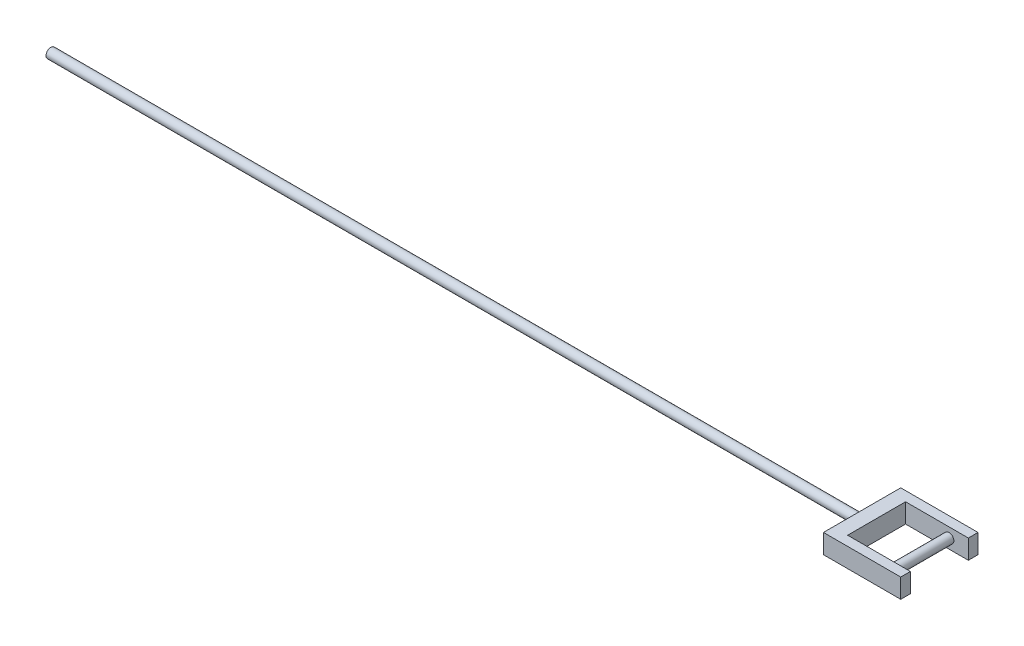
ISO-10303-21;
HEADER;
FILE_DESCRIPTION(('STEP AP214'),'2;1');
FILE_NAME('part.step','',(''),(''),'','','');
FILE_SCHEMA(('AUTOMOTIVE_DESIGN { 1 0 10303 214 1 1 1 1 }'));
ENDSEC;
DATA;
#1=APPLICATION_CONTEXT('core data for automotive mechanical design processes');
#2=APPLICATION_PROTOCOL_DEFINITION('international standard','automotive_design',2000,#1);
#3=PRODUCT_CONTEXT('',#1,'mechanical');
#4=PRODUCT('Part','Part','',(#3));
#5=PRODUCT_RELATED_PRODUCT_CATEGORY('part','',(#4));
#6=PRODUCT_DEFINITION_FORMATION('','',#4);
#7=PRODUCT_DEFINITION_CONTEXT('part definition',#1,'design');
#8=PRODUCT_DEFINITION('design','',#6,#7);
#9=PRODUCT_DEFINITION_SHAPE('','',#8);
#10=(LENGTH_UNIT() NAMED_UNIT(*) SI_UNIT(.MILLI.,.METRE.));
#11=(NAMED_UNIT(*) PLANE_ANGLE_UNIT() SI_UNIT($,.RADIAN.));
#12=(NAMED_UNIT(*) SI_UNIT($,.STERADIAN.) SOLID_ANGLE_UNIT());
#13=UNCERTAINTY_MEASURE_WITH_UNIT(LENGTH_MEASURE(1.E-05),#10,'distance_accuracy_value','');
#14=(GEOMETRIC_REPRESENTATION_CONTEXT(3) GLOBAL_UNCERTAINTY_ASSIGNED_CONTEXT((#13)) GLOBAL_UNIT_ASSIGNED_CONTEXT((#10,
#11,#12)) REPRESENTATION_CONTEXT('',''));
#15=CARTESIAN_POINT('',(0.,0.,0.));
#16=DIRECTION('',(0.,0.,1.));
#17=DIRECTION('',(1.,0.,0.));
#18=AXIS2_PLACEMENT_3D('',#15,#16,#17);
#19=CARTESIAN_POINT('',(50.8,25.4,-76.2));
#20=DIRECTION('',(-1.,0.,0.));
#21=DIRECTION('',(0.,0.,1.));
#22=AXIS2_PLACEMENT_3D('',#19,#20,#21);
#23=PLANE('',#22);
#24=DIRECTION('',(0.,0.,-1.));
#25=VECTOR('',#24,1.);
#26=CARTESIAN_POINT('',(50.8,-25.4,-76.2));
#27=LINE('',#26,#25);
#28=CARTESIAN_POINT('',(50.8,-25.4,-76.2));
#29=VERTEX_POINT('',#28);
#30=CARTESIAN_POINT('',(50.8,-25.4,-101.6));
#31=VERTEX_POINT('',#30);
#32=EDGE_CURVE('E131',#29,#31,#27,.T.);
#33=ORIENTED_EDGE('',*,*,#32,.T.);
#34=DIRECTION('',(0.,-1.,0.));
#35=VECTOR('',#34,1.);
#36=CARTESIAN_POINT('',(50.8,25.4,-101.6));
#37=LINE('',#36,#35);
#38=CARTESIAN_POINT('',(50.8,25.4,-101.6));
#39=VERTEX_POINT('',#38);
#40=EDGE_CURVE('E42',#39,#31,#37,.T.);
#41=ORIENTED_EDGE('',*,*,#40,.F.);
#42=DIRECTION('',(0.,0.,-1.));
#43=VECTOR('',#42,1.);
#44=CARTESIAN_POINT('',(50.8,25.4,-76.2));
#45=LINE('',#44,#43);
#46=CARTESIAN_POINT('',(50.8,25.4,-76.2));
#47=VERTEX_POINT('',#46);
#48=EDGE_CURVE('E146',#47,#39,#45,.T.);
#49=ORIENTED_EDGE('',*,*,#48,.F.);
#50=DIRECTION('',(0.,-1.,0.));
#51=VECTOR('',#50,1.);
#52=CARTESIAN_POINT('',(50.8,25.4,-76.2));
#53=LINE('',#52,#51);
#54=EDGE_CURVE('E127',#47,#29,#53,.T.);
#55=ORIENTED_EDGE('',*,*,#54,.T.);
#56=EDGE_LOOP('',(#33,#41,#49,#55));
#57=FACE_BOUND('',#56,.T.);
#58=ADVANCED_FACE('F34',(#57),#23,.F.);
#59=CARTESIAN_POINT('',(50.8,25.4,-101.6));
#60=DIRECTION('',(0.,0.,1.));
#61=DIRECTION('',(1.,0.,0.));
#62=AXIS2_PLACEMENT_3D('',#59,#60,#61);
#63=PLANE('',#62);
#64=DIRECTION('',(-1.,0.,0.));
#65=VECTOR('',#64,1.);
#66=CARTESIAN_POINT('',(50.8,-25.4,-101.6));
#67=LINE('',#66,#65);
#68=CARTESIAN_POINT('',(-152.4,-25.4,-101.6));
#69=VERTEX_POINT('',#68);
#70=EDGE_CURVE('E134',#31,#69,#67,.T.);
#71=ORIENTED_EDGE('',*,*,#70,.T.);
#72=DIRECTION('',(0.,-1.,0.));
#73=VECTOR('',#72,1.);
#74=CARTESIAN_POINT('',(-152.4,25.4,-101.6));
#75=LINE('',#74,#73);
#76=CARTESIAN_POINT('',(-152.4,25.4,-101.6));
#77=VERTEX_POINT('',#76);
#78=EDGE_CURVE('E156',#77,#69,#75,.T.);
#79=ORIENTED_EDGE('',*,*,#78,.F.);
#80=DIRECTION('',(-1.,0.,0.));
#81=VECTOR('',#80,1.);
#82=CARTESIAN_POINT('',(50.8,25.4,-101.6));
#83=LINE('',#82,#81);
#84=EDGE_CURVE('E94',#39,#77,#83,.T.);
#85=ORIENTED_EDGE('',*,*,#84,.F.);
#86=ORIENTED_EDGE('',*,*,#40,.T.);
#87=EDGE_LOOP('',(#71,#79,#85,#86));
#88=FACE_BOUND('',#87,.T.);
#89=ADVANCED_FACE('F159',(#88),#63,.F.);
#90=CARTESIAN_POINT('',(-152.4,25.4,-101.6));
#91=DIRECTION('',(1.,0.,0.));
#92=DIRECTION('',(0.,0.,-1.));
#93=AXIS2_PLACEMENT_3D('',#90,#91,#92);
#94=PLANE('',#93);
#95=CARTESIAN_POINT('',(-152.4,0.,0.));
#96=DIRECTION('',(1.,0.,0.));
#97=DIRECTION('',(0.,0.,-1.));
#98=AXIS2_PLACEMENT_3D('',#95,#96,#97);
#99=CIRCLE('',#98,12.7);
#100=CARTESIAN_POINT('',(-152.4,0.,-12.7));
#101=VERTEX_POINT('',#100);
#102=EDGE_CURVE('E11',#101,#101,#99,.F.);
#103=ORIENTED_EDGE('',*,*,#102,.F.);
#104=EDGE_LOOP('',(#103));
#105=FACE_BOUND('',#104,.T.);
#106=DIRECTION('',(0.,0.,1.));
#107=VECTOR('',#106,1.);
#108=CARTESIAN_POINT('',(-152.4,-25.4,-101.6));
#109=LINE('',#108,#107);
#110=CARTESIAN_POINT('',(-152.4,-25.4,101.6));
#111=VERTEX_POINT('',#110);
#112=EDGE_CURVE('E137',#69,#111,#109,.T.);
#113=ORIENTED_EDGE('',*,*,#112,.T.);
#114=DIRECTION('',(0.,-1.,0.));
#115=VECTOR('',#114,1.);
#116=CARTESIAN_POINT('',(-152.4,25.4,101.6));
#117=LINE('',#116,#115);
#118=CARTESIAN_POINT('',(-152.4,25.4,101.6));
#119=VERTEX_POINT('',#118);
#120=EDGE_CURVE('E153',#119,#111,#117,.T.);
#121=ORIENTED_EDGE('',*,*,#120,.F.);
#122=DIRECTION('',(0.,0.,1.));
#123=VECTOR('',#122,1.);
#124=CARTESIAN_POINT('',(-152.4,25.4,-101.6));
#125=LINE('',#124,#123);
#126=EDGE_CURVE('E177',#77,#119,#125,.T.);
#127=ORIENTED_EDGE('',*,*,#126,.F.);
#128=ORIENTED_EDGE('',*,*,#78,.T.);
#129=EDGE_LOOP('',(#113,#121,#127,#128));
#130=FACE_BOUND('',#129,.T.);
#131=ADVANCED_FACE('F170',(#105,#130),#94,.F.);
#132=CARTESIAN_POINT('',(-152.4,25.4,101.6));
#133=DIRECTION('',(0.,0.,-1.));
#134=DIRECTION('',(-1.,0.,0.));
#135=AXIS2_PLACEMENT_3D('',#132,#133,#134);
#136=PLANE('',#135);
#137=DIRECTION('',(1.,0.,0.));
#138=VECTOR('',#137,1.);
#139=CARTESIAN_POINT('',(-152.4,-25.4,101.6));
#140=LINE('',#139,#138);
#141=CARTESIAN_POINT('',(50.8,-25.4,101.6));
#142=VERTEX_POINT('',#141);
#143=EDGE_CURVE('E139',#111,#142,#140,.T.);
#144=ORIENTED_EDGE('',*,*,#143,.T.);
#145=DIRECTION('',(0.,-1.,0.));
#146=VECTOR('',#145,1.);
#147=CARTESIAN_POINT('',(50.8,25.4,101.6));
#148=LINE('',#147,#146);
#149=CARTESIAN_POINT('',(50.8,25.4,101.6));
#150=VERTEX_POINT('',#149);
#151=EDGE_CURVE('E150',#150,#142,#148,.T.);
#152=ORIENTED_EDGE('',*,*,#151,.F.);
#153=DIRECTION('',(1.,0.,0.));
#154=VECTOR('',#153,1.);
#155=CARTESIAN_POINT('',(-152.4,25.4,101.6));
#156=LINE('',#155,#154);
#157=EDGE_CURVE('E176',#119,#150,#156,.T.);
#158=ORIENTED_EDGE('',*,*,#157,.F.);
#159=ORIENTED_EDGE('',*,*,#120,.T.);
#160=EDGE_LOOP('',(#144,#152,#158,#159));
#161=FACE_BOUND('',#160,.T.);
#162=ADVANCED_FACE('F174',(#161),#136,.F.);
#163=CARTESIAN_POINT('',(50.8,25.4,101.6));
#164=DIRECTION('',(-1.,0.,0.));
#165=DIRECTION('',(0.,0.,1.));
#166=AXIS2_PLACEMENT_3D('',#163,#164,#165);
#167=PLANE('',#166);
#168=DIRECTION('',(0.,0.,-1.));
#169=VECTOR('',#168,1.);
#170=CARTESIAN_POINT('',(50.8,-25.4,101.6));
#171=LINE('',#170,#169);
#172=CARTESIAN_POINT('',(50.8,-25.4,76.2));
#173=VERTEX_POINT('',#172);
#174=EDGE_CURVE('E141',#142,#173,#171,.T.);
#175=ORIENTED_EDGE('',*,*,#174,.T.);
#176=DIRECTION('',(0.,-1.,0.));
#177=VECTOR('',#176,1.);
#178=CARTESIAN_POINT('',(50.8,25.4,76.2));
#179=LINE('',#178,#177);
#180=CARTESIAN_POINT('',(50.8,25.4,76.2));
#181=VERTEX_POINT('',#180);
#182=EDGE_CURVE('E122',#181,#173,#179,.T.);
#183=ORIENTED_EDGE('',*,*,#182,.F.);
#184=DIRECTION('',(0.,0.,-1.));
#185=VECTOR('',#184,1.);
#186=CARTESIAN_POINT('',(50.8,25.4,101.6));
#187=LINE('',#186,#185);
#188=EDGE_CURVE('E113',#150,#181,#187,.T.);
#189=ORIENTED_EDGE('',*,*,#188,.F.);
#190=ORIENTED_EDGE('',*,*,#151,.T.);
#191=EDGE_LOOP('',(#175,#183,#189,#190));
#192=FACE_BOUND('',#191,.T.);
#193=ADVANCED_FACE('F207',(#192),#167,.F.);
#194=CARTESIAN_POINT('',(50.8,25.4,76.2));
#195=DIRECTION('',(0.,0.,1.));
#196=DIRECTION('',(1.,0.,0.));
#197=AXIS2_PLACEMENT_3D('',#194,#195,#196);
#198=PLANE('',#197);
#199=CARTESIAN_POINT('',(0.,0.,76.2));
#200=DIRECTION('',(0.,0.,1.));
#201=DIRECTION('',(1.,0.,0.));
#202=AXIS2_PLACEMENT_3D('',#199,#200,#201);
#203=CIRCLE('',#202,12.7);
#204=CARTESIAN_POINT('',(12.7,0.,76.2));
#205=VERTEX_POINT('',#204);
#206=EDGE_CURVE('E135',#205,#205,#203,.T.);
#207=ORIENTED_EDGE('',*,*,#206,.T.);
#208=EDGE_LOOP('',(#207));
#209=FACE_BOUND('',#208,.T.);
#210=DIRECTION('',(-1.,0.,0.));
#211=VECTOR('',#210,1.);
#212=CARTESIAN_POINT('',(50.8,-25.4,76.2));
#213=LINE('',#212,#211);
#214=CARTESIAN_POINT('',(-114.3,-25.4,76.2));
#215=VERTEX_POINT('',#214);
#216=EDGE_CURVE('E121',#173,#215,#213,.T.);
#217=ORIENTED_EDGE('',*,*,#216,.T.);
#218=DIRECTION('',(0.,-1.,0.));
#219=VECTOR('',#218,1.);
#220=CARTESIAN_POINT('',(-114.3,25.4,76.2));
#221=LINE('',#220,#219);
#222=CARTESIAN_POINT('',(-114.3,25.4,76.2));
#223=VERTEX_POINT('',#222);
#224=EDGE_CURVE('E118',#223,#215,#221,.T.);
#225=ORIENTED_EDGE('',*,*,#224,.F.);
#226=DIRECTION('',(-1.,0.,0.));
#227=VECTOR('',#226,1.);
#228=CARTESIAN_POINT('',(50.8,25.4,76.2));
#229=LINE('',#228,#227);
#230=EDGE_CURVE('E107',#181,#223,#229,.T.);
#231=ORIENTED_EDGE('',*,*,#230,.F.);
#232=ORIENTED_EDGE('',*,*,#182,.T.);
#233=EDGE_LOOP('',(#217,#225,#231,#232));
#234=FACE_BOUND('',#233,.T.);
#235=ADVANCED_FACE('F119',(#209,#234),#198,.F.);
#236=CARTESIAN_POINT('',(-114.3,25.4,76.2));
#237=DIRECTION('',(-1.,0.,0.));
#238=DIRECTION('',(0.,0.,1.));
#239=AXIS2_PLACEMENT_3D('',#236,#237,#238);
#240=PLANE('',#239);
#241=DIRECTION('',(0.,0.,-1.));
#242=VECTOR('',#241,1.);
#243=CARTESIAN_POINT('',(-114.3,-25.4,76.2));
#244=LINE('',#243,#242);
#245=CARTESIAN_POINT('',(-114.3,-25.4,-76.2));
#246=VERTEX_POINT('',#245);
#247=EDGE_CURVE('E79',#215,#246,#244,.T.);
#248=ORIENTED_EDGE('',*,*,#247,.T.);
#249=DIRECTION('',(0.,-1.,0.));
#250=VECTOR('',#249,1.);
#251=CARTESIAN_POINT('',(-114.3,25.4,-76.2));
#252=LINE('',#251,#250);
#253=CARTESIAN_POINT('',(-114.3,25.4,-76.2));
#254=VERTEX_POINT('',#253);
#255=EDGE_CURVE('E123',#254,#246,#252,.T.);
#256=ORIENTED_EDGE('',*,*,#255,.F.);
#257=DIRECTION('',(0.,0.,-1.));
#258=VECTOR('',#257,1.);
#259=CARTESIAN_POINT('',(-114.3,25.4,76.2));
#260=LINE('',#259,#258);
#261=EDGE_CURVE('E111',#223,#254,#260,.T.);
#262=ORIENTED_EDGE('',*,*,#261,.F.);
#263=ORIENTED_EDGE('',*,*,#224,.T.);
#264=EDGE_LOOP('',(#248,#256,#262,#263));
#265=FACE_BOUND('',#264,.T.);
#266=ADVANCED_FACE('F125',(#265),#240,.F.);
#267=CARTESIAN_POINT('',(-114.3,25.4,-76.2));
#268=DIRECTION('',(0.,0.,-1.));
#269=DIRECTION('',(-1.,0.,0.));
#270=AXIS2_PLACEMENT_3D('',#267,#268,#269);
#271=PLANE('',#270);
#272=CARTESIAN_POINT('',(0.,0.,-76.2));
#273=DIRECTION('',(0.,0.,-1.));
#274=DIRECTION('',(-1.,0.,0.));
#275=AXIS2_PLACEMENT_3D('',#272,#273,#274);
#276=CIRCLE('',#275,12.7);
#277=CARTESIAN_POINT('',(12.7,0.,-76.2));
#278=VERTEX_POINT('',#277);
#279=EDGE_CURVE('E185',#278,#278,#276,.F.);
#280=ORIENTED_EDGE('',*,*,#279,.F.);
#281=EDGE_LOOP('',(#280));
#282=FACE_BOUND('',#281,.T.);
#283=DIRECTION('',(1.,0.,0.));
#284=VECTOR('',#283,1.);
#285=CARTESIAN_POINT('',(-114.3,-25.4,-76.2));
#286=LINE('',#285,#284);
#287=EDGE_CURVE('E85',#246,#29,#286,.T.);
#288=ORIENTED_EDGE('',*,*,#287,.T.);
#289=ORIENTED_EDGE('',*,*,#54,.F.);
#290=DIRECTION('',(1.,0.,0.));
#291=VECTOR('',#290,1.);
#292=CARTESIAN_POINT('',(-114.3,25.4,-76.2));
#293=LINE('',#292,#291);
#294=EDGE_CURVE('E50',#254,#47,#293,.T.);
#295=ORIENTED_EDGE('',*,*,#294,.F.);
#296=ORIENTED_EDGE('',*,*,#255,.T.);
#297=EDGE_LOOP('',(#288,#289,#295,#296));
#298=FACE_BOUND('',#297,.T.);
#299=ADVANCED_FACE('F238',(#282,#298),#271,.F.);
#300=CARTESIAN_POINT('',(0.,25.4,0.));
#301=DIRECTION('',(0.,1.,0.));
#302=DIRECTION('',(0.,0.,1.));
#303=AXIS2_PLACEMENT_3D('',#300,#301,#302);
#304=PLANE('',#303);
#305=ORIENTED_EDGE('',*,*,#48,.T.);
#306=ORIENTED_EDGE('',*,*,#84,.T.);
#307=ORIENTED_EDGE('',*,*,#126,.T.);
#308=ORIENTED_EDGE('',*,*,#157,.T.);
#309=ORIENTED_EDGE('',*,*,#188,.T.);
#310=ORIENTED_EDGE('',*,*,#230,.T.);
#311=ORIENTED_EDGE('',*,*,#261,.T.);
#312=ORIENTED_EDGE('',*,*,#294,.T.);
#313=EDGE_LOOP('',(#305,#306,#307,#308,#309,#310,#311,#312));
#314=FACE_BOUND('',#313,.T.);
#315=ADVANCED_FACE('F109',(#314),#304,.T.);
#316=CARTESIAN_POINT('',(0.,-25.4,0.));
#317=DIRECTION('',(0.,1.,0.));
#318=DIRECTION('',(0.,0.,1.));
#319=AXIS2_PLACEMENT_3D('',#316,#317,#318);
#320=PLANE('',#319);
#321=ORIENTED_EDGE('',*,*,#32,.F.);
#322=ORIENTED_EDGE('',*,*,#287,.F.);
#323=ORIENTED_EDGE('',*,*,#247,.F.);
#324=ORIENTED_EDGE('',*,*,#216,.F.);
#325=ORIENTED_EDGE('',*,*,#174,.F.);
#326=ORIENTED_EDGE('',*,*,#143,.F.);
#327=ORIENTED_EDGE('',*,*,#112,.F.);
#328=ORIENTED_EDGE('',*,*,#70,.F.);
#329=EDGE_LOOP('',(#321,#322,#323,#324,#325,#326,#327,#328));
#330=FACE_BOUND('',#329,.T.);
#331=ADVANCED_FACE('F164',(#330),#320,.F.);
#332=CARTESIAN_POINT('',(0.,0.,-112.121024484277));
#333=DIRECTION('',(0.,0.,1.));
#334=DIRECTION('',(1.,0.,0.));
#335=AXIS2_PLACEMENT_3D('',#332,#333,#334);
#336=CYLINDRICAL_SURFACE('',#335,12.7);
#337=CARTESIAN_POINT('',(12.7,0.,-76.2));
#338=CARTESIAN_POINT('',(12.7,0.,-74.6125));
#339=CARTESIAN_POINT('',(12.7,0.,-73.025));
#340=CARTESIAN_POINT('',(12.7,0.,-69.85));
#341=CARTESIAN_POINT('',(12.7,0.,-68.2625));
#342=CARTESIAN_POINT('',(12.7,0.,-65.0875));
#343=CARTESIAN_POINT('',(12.7,0.,-63.5));
#344=CARTESIAN_POINT('',(12.7,0.,-60.325));
#345=CARTESIAN_POINT('',(12.7,0.,-58.7375));
#346=CARTESIAN_POINT('',(12.7,0.,-55.5625));
#347=CARTESIAN_POINT('',(12.7,0.,-53.975));
#348=CARTESIAN_POINT('',(12.7,0.,-50.8));
#349=CARTESIAN_POINT('',(12.7,0.,-49.2125));
#350=CARTESIAN_POINT('',(12.7,0.,-46.0375));
#351=CARTESIAN_POINT('',(12.7,0.,-44.45));
#352=CARTESIAN_POINT('',(12.7,0.,-41.275));
#353=CARTESIAN_POINT('',(12.7,0.,-39.6875));
#354=CARTESIAN_POINT('',(12.7,0.,-36.5125));
#355=CARTESIAN_POINT('',(12.7,0.,-34.925));
#356=CARTESIAN_POINT('',(12.7,0.,-31.75));
#357=CARTESIAN_POINT('',(12.7,0.,-30.1625));
#358=CARTESIAN_POINT('',(12.7,0.,-26.9875));
#359=CARTESIAN_POINT('',(12.7,0.,-25.4));
#360=CARTESIAN_POINT('',(12.7,0.,-22.225));
#361=CARTESIAN_POINT('',(12.7,0.,-20.6375));
#362=CARTESIAN_POINT('',(12.7,0.,-17.4625));
#363=CARTESIAN_POINT('',(12.7,0.,-15.875));
#364=CARTESIAN_POINT('',(12.7,0.,-12.7));
#365=CARTESIAN_POINT('',(12.7,0.,-11.1125));
#366=CARTESIAN_POINT('',(12.7,0.,-7.93750000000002));
#367=CARTESIAN_POINT('',(12.7,0.,-6.35000000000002));
#368=CARTESIAN_POINT('',(12.7,0.,-3.17500000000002));
#369=CARTESIAN_POINT('',(12.7,0.,-1.58750000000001));
#370=CARTESIAN_POINT('',(12.7,0.,1.58749999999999));
#371=CARTESIAN_POINT('',(12.7,0.,3.17499999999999));
#372=CARTESIAN_POINT('',(12.7,0.,6.34999999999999));
#373=CARTESIAN_POINT('',(12.7,0.,7.93749999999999));
#374=CARTESIAN_POINT('',(12.7,0.,11.1125));
#375=CARTESIAN_POINT('',(12.7,0.,12.7));
#376=CARTESIAN_POINT('',(12.7,0.,15.875));
#377=CARTESIAN_POINT('',(12.7,0.,17.4625));
#378=CARTESIAN_POINT('',(12.7,0.,20.6375));
#379=CARTESIAN_POINT('',(12.7,0.,22.225));
#380=CARTESIAN_POINT('',(12.7,0.,25.4));
#381=CARTESIAN_POINT('',(12.7,0.,26.9875));
#382=CARTESIAN_POINT('',(12.7,0.,30.1625));
#383=CARTESIAN_POINT('',(12.7,0.,31.75));
#384=CARTESIAN_POINT('',(12.7,0.,34.925));
#385=CARTESIAN_POINT('',(12.7,0.,36.5125));
#386=CARTESIAN_POINT('',(12.7,0.,39.6875));
#387=CARTESIAN_POINT('',(12.7,0.,41.275));
#388=CARTESIAN_POINT('',(12.7,0.,44.45));
#389=CARTESIAN_POINT('',(12.7,0.,46.0375));
#390=CARTESIAN_POINT('',(12.7,0.,49.2125));
#391=CARTESIAN_POINT('',(12.7,0.,50.8));
#392=CARTESIAN_POINT('',(12.7,0.,53.975));
#393=CARTESIAN_POINT('',(12.7,0.,55.5625));
#394=CARTESIAN_POINT('',(12.7,0.,58.7375));
#395=CARTESIAN_POINT('',(12.7,0.,60.325));
#396=CARTESIAN_POINT('',(12.7,0.,63.5));
#397=CARTESIAN_POINT('',(12.7,0.,65.0875));
#398=CARTESIAN_POINT('',(12.7,0.,68.2625));
#399=CARTESIAN_POINT('',(12.7,0.,69.85));
#400=CARTESIAN_POINT('',(12.7,0.,73.025));
#401=CARTESIAN_POINT('',(12.7,0.,74.6125));
#402=CARTESIAN_POINT('',(12.7,0.,76.2));
#403=B_SPLINE_CURVE_WITH_KNOTS('',3,(#337,#338,#339,#340,#341,#342,#343,#344,#345,#346,#347,
#348,#349,#350,#351,#352,#353,#354,#355,#356,#357,#358,#359,#360,#361,#362,#363,#364,#365,#366,
#367,#368,#369,#370,#371,#372,#373,#374,#375,#376,#377,#378,#379,#380,#381,#382,#383,#384,#385,
#386,#387,#388,#389,#390,#391,#392,#393,#394,#395,#396,#397,#398,#399,#400,#401,#402),
.UNSPECIFIED.,.F.,.F.,(4,2,2,2,2,2,2,2,2,2,2,2,2,2,2,2,2,2,2,2,2,2,2,2,2,2,2,2,2,2,2,2,4),(0.,
4.7625,9.52500000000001,14.2875,19.05,23.8125,28.575,33.3375,38.1,42.8625,47.625,52.3875,57.15,
61.9125,66.675,71.4375,76.2,80.9625,85.725,90.4875,95.25,100.0125,104.775,109.5375,114.3,
119.0625,123.825,128.5875,133.35,138.1125,142.875,147.6375,152.4),.UNSPECIFIED.);
#404=EDGE_CURVE('BSEAM197',#278,#205,#403,.T.);
#405=ORIENTED_EDGE('',*,*,#279,.T.);
#406=ORIENTED_EDGE('',*,*,#206,.F.);
#407=ORIENTED_EDGE('',*,*,#404,.T.);
#408=ORIENTED_EDGE('',*,*,#404,.F.);
#409=EDGE_LOOP('',(#405,#407,#406,#408));
#410=FACE_BOUND('',#409,.T.);
#411=ADVANCED_FACE('F197',(#410),#336,.T.);
#412=CARTESIAN_POINT('',(-2286.,0.,0.));
#413=DIRECTION('',(1.,0.,0.));
#414=DIRECTION('',(0.,0.,-1.));
#415=AXIS2_PLACEMENT_3D('',#412,#413,#414);
#416=CYLINDRICAL_SURFACE('',#415,12.7);
#417=CARTESIAN_POINT('',(-2286.,0.,0.));
#418=DIRECTION('',(-1.,0.,0.));
#419=DIRECTION('',(0.,0.,1.));
#420=AXIS2_PLACEMENT_3D('',#417,#418,#419);
#421=CIRCLE('',#420,12.7);
#422=CARTESIAN_POINT('',(-2286.,0.,12.7));
#423=VERTEX_POINT('',#422);
#424=EDGE_CURVE('E188',#423,#423,#421,.T.);
#425=ORIENTED_EDGE('',*,*,#424,.F.);
#426=EDGE_LOOP('',(#425));
#427=FACE_BOUND('',#426,.T.);
#428=ORIENTED_EDGE('',*,*,#102,.T.);
#429=EDGE_LOOP('',(#428));
#430=FACE_BOUND('',#429,.T.);
#431=ADVANCED_FACE('F194',(#427,#430),#416,.T.);
#432=CARTESIAN_POINT('',(-2286.,0.,0.));
#433=DIRECTION('',(-1.,0.,0.));
#434=DIRECTION('',(0.,0.,1.));
#435=AXIS2_PLACEMENT_3D('',#432,#433,#434);
#436=PLANE('',#435);
#437=ORIENTED_EDGE('',*,*,#424,.T.);
#438=EDGE_LOOP('',(#437));
#439=FACE_BOUND('',#438,.T.);
#440=ADVANCED_FACE('F192',(#439),#436,.T.);
#441=CLOSED_SHELL('',(#58,#89,#131,#162,#193,#235,#266,#299,#315,#331,#411,#431,#440));
#442=MANIFOLD_SOLID_BREP('B2',#441);
#443=ADVANCED_BREP_SHAPE_REPRESENTATION('',(#18,#442),#14);
#444=SHAPE_DEFINITION_REPRESENTATION(#9,#443);
ENDSEC;
END-ISO-10303-21;
